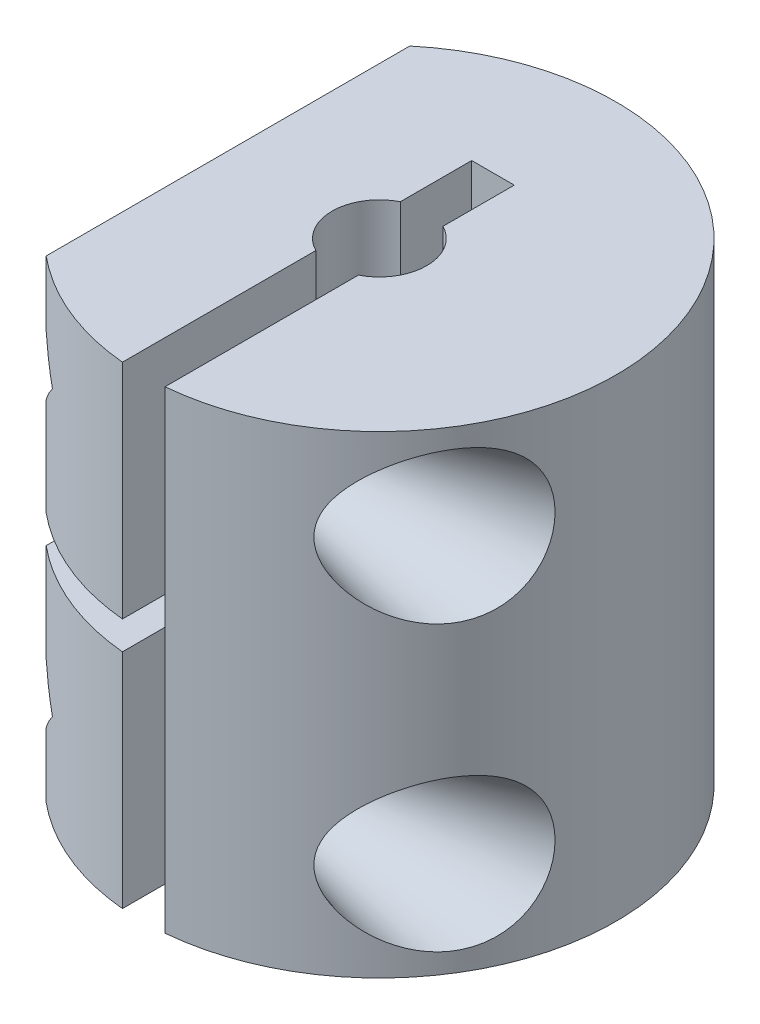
from build123d import *

# Parameters (mm, degrees)
SKETCH1_R                    = 12.5
BOSS_EXTRUDE1_DEPTH          = 25
SKETCH2_R                    = 2.5
CUT_EXTRUDE1_DEPTH           = 31.618621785
SKETCH3_W                    = 2.25
SKETCH3_H                    = 19
CUT_EXTRUDE2_DEPTH           = 31.618621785
SKETCH4_R                    = 1.5
CUT_EXTRUDE3_DEPTH           = 15
CUT_EXTRUDE3_TAPER           = -15
CUT_EXTRUDE3_OTHER_WAY_DEPTH = 32.09486493
SKETCH11_W                   = 18.449272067
SKETCH11_H                   = 1.5
CUT_EXTRUDE4_DEPTH           = 32.094865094
CUT_EXTRUDE5_DEPTH           = 31.618621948
CUT_EXTRUDE6_DEPTH           = 3


with BuildPart() as part:
    # Sketch1 → Boss-Extrude1 (new body)
    with BuildSketch(Plane(origin=(0, 0, 0), x_dir=(1, 0, 0), z_dir=(0, 1, 0))):
        with Locations(Location((0, 0, 0), (0, 0, 270))):
            Circle(SKETCH1_R)
    extrude(amount=BOSS_EXTRUDE1_DEPTH)

    # Sketch2 → Cut-Extrude1 (cut, through all)
    with BuildSketch(Plane(origin=(0, 25, 0), x_dir=(1, 0, 0), z_dir=(0, 1, 0))):
        with Locations(Location((0, 0, 0), (0, 0, 270))):
            Circle(SKETCH2_R)
    extrude(amount=-CUT_EXTRUDE1_DEPTH, mode=Mode.SUBTRACT)

    # Sketch3 → Cut-Extrude2 (cut, through all)
    with BuildSketch(Plane(origin=(0, 25, 0), x_dir=(1, 0, 0), z_dir=(0, 1, 0))):
        with Locations((0, -3.5)):
            Rectangle(SKETCH3_W, SKETCH3_H)
    extrude(amount=-CUT_EXTRUDE2_DEPTH, mode=Mode.SUBTRACT)

    # Sketch4 → Cut-Extrude3 (cut)
    with BuildSketch(Plane.ZY.offset(-1.125)):
        with Locations(Location((7.340921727, 20, 0), (0, 0, 180))):
            Circle(SKETCH4_R)
        with Locations(Location((7.340921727, 5, 0), (0, 0, 180))):
            Circle(SKETCH4_R)
    extrude(amount=-CUT_EXTRUDE3_DEPTH, taper=CUT_EXTRUDE3_TAPER, mode=Mode.SUBTRACT)

    # Sketch4 → Cut-Extrude3 other way (cut)
    with BuildSketch(Plane.ZY.offset(-1.125)):
        with Locations(Location((7.340921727, 20, 0), (0, 0, 180))):
            Circle(SKETCH4_R)
        with Locations(Location((7.340921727, 5, 0), (0, 0, 180))):
            Circle(SKETCH4_R)
    extrude(amount=CUT_EXTRUDE3_OTHER_WAY_DEPTH, mode=Mode.SUBTRACT)

    # Sketch11 → Cut-Extrude4 (cut, through all)
    with BuildSketch(Plane.ZY.offset(-1.125)):
        with Locations((3.224636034, 12.5)):
            Rectangle(SKETCH11_W, SKETCH11_H)
    extrude(amount=CUT_EXTRUDE4_DEPTH, mode=Mode.SUBTRACT)

    # Sketch12 → Cut-Extrude5 (cut, through all)
    with BuildSketch(Plane(origin=(0, 25, 0), x_dir=(1, 0, 0), z_dir=(0, 1, 0))):
        with BuildLine():
            Line((-8, 9.604686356), (-8, -9.604686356))
            ThreePointArc((-8, -9.604686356), (-12.5, 0), (-8, 9.604686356))
        make_face()
    extrude(amount=-CUT_EXTRUDE5_DEPTH, mode=Mode.SUBTRACT)

    # Sketch14 → Cut-Extrude6 (cut)
    with BuildSketch(Plane.ZY.offset(8)):
        Polygon((4.165495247, 20), (5.753208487, 17.25), (8.928634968, 17.25), (10.516348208, 20), (8.928634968, 22.75), (5.753208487, 22.75), align=None)
        Polygon((5.753208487, 2.25), (4.165495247, 5), (5.753208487, 7.75), (8.928634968, 7.75), (10.516348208, 5), (8.928634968, 2.25), align=None)
    extrude(amount=-CUT_EXTRUDE6_DEPTH, mode=Mode.SUBTRACT)


solid = part.part
